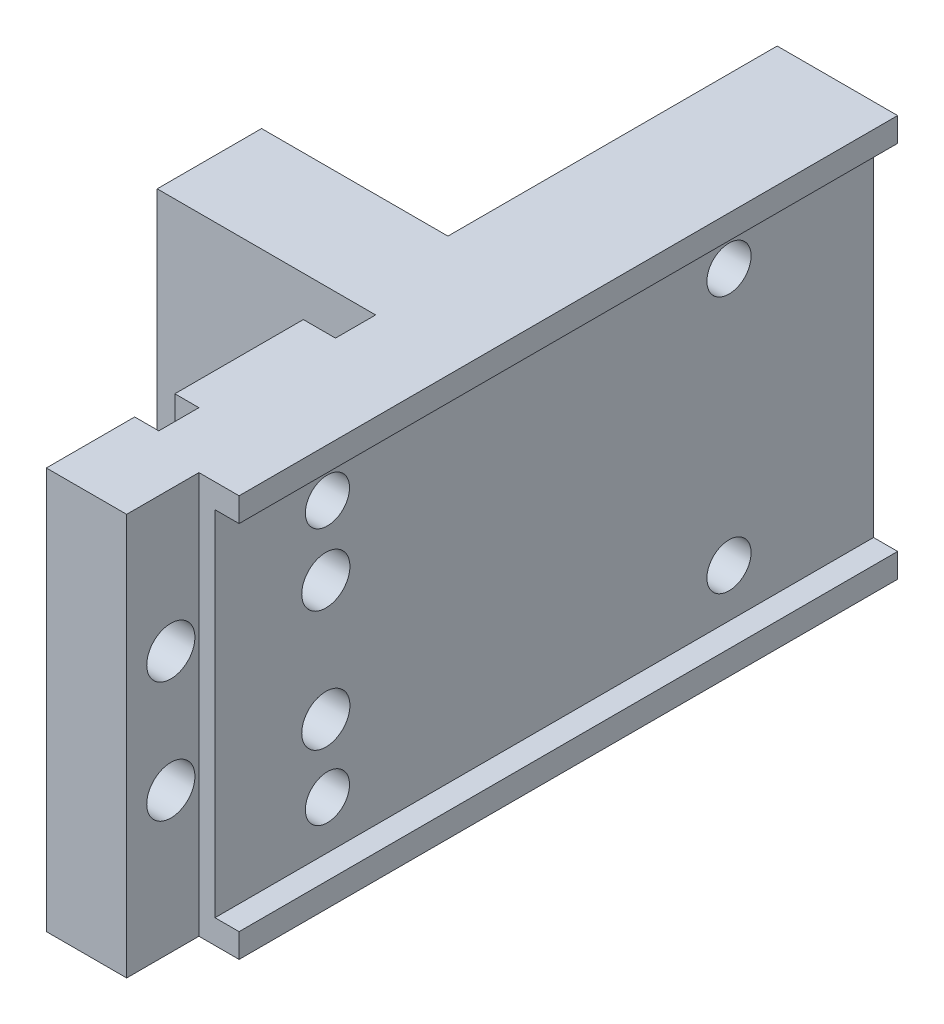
from build123d import *

# Parameters (mm, degrees)
LINEAR_AUSTRAGEN1_DEPTH                              = 25
SCHNITT_LINEAR_AUSTRAGEN1_REACH                      = 103.81
SKIZZE2_W                                            = 3
SKIZZE2_H                                            = 44
SCHNITT_LINEAR_AUSTRAGEN2_DEPTH                      = 5
F_16_5_16_5_DURCHMESSER_BOHRUNG1_D                   = 16.5
SCHNITT_LINEAR_AUSTRAGEN3_REACH                      = 69.707
SKIZZE7_W                                            = 1
SKIZZE7_H                                            = 25
STIRNSENKUNG_F_R_M6_ZYLINDERSCHRAUBE_MIT_D           = 6.6
STIRNSENKUNG_F_R_M6_ZYLINDERSCHRAUBE_MIT_DEPTH       = 13
STIRNSENKUNG_F_R_M6_ZYLINDERSCHRAUBE_MIT_CBORE_D     = 11
STIRNSENKUNG_F_R_M6_ZYLINDERSCHRAUBE_MIT_CBORE_DEPTH = 6
M6X1_0_GEWINDEBOHRUNG1_D                             = 5
M6X1_0_GEWINDEBOHRUNG1_DEPTH                         = 15
M6X1_0_GEWINDEBOHRUNG1_CBORE_D                       = 6
M6X1_0_GEWINDEBOHRUNG1_CBORE_DEPTH                   = 12
M6X1_0_GEWINDEBOHRUNG1_TIP                           = 1.502151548
F_5_5_5_5_DURCHMESSER_BOHRUNG1_D                     = 5.5
STIRNSENKUNG_F_R_M5_ZYLINDERSCHRAUBE_MIT_D           = 5.5
STIRNSENKUNG_F_R_M5_ZYLINDERSCHRAUBE_MIT_CBORE_D     = 10
STIRNSENKUNG_F_R_M5_ZYLINDERSCHRAUBE_MIT_CBORE_DEPTH = 5
M6X1_0_GEWINDEBOHRUNG3_D                             = 6
M6X1_0_GEWINDEBOHRUNG3_DEPTH                         = 12


with BuildPart() as part:
    # Skizze1 → Linear austragen1 (new, symmetric)
    with BuildSketch(Plane(origin=(0, 0, 0), x_dir=(1, 0, 0), z_dir=(0, 1, 0))):
        Polygon((-15, 41), (0, 41), (0, -41), (-5, -41), (-5, -50), (-15, -50), (-15, -39), (-12, -39), (-12, -34), (-15, -34), (-15, -18), (-11, -18), (-11, -13), (-38.2, -13), (-38.2, 0), (-15, 0), align=None)
    extrude(amount=LINEAR_AUSTRAGEN1_DEPTH, both=True)

    # Skizze2 → Schnitt-Linear austragen1 (cut, up to next)
    with BuildSketch(Plane(origin=(0, 0, -41), x_dir=(-1, 0, 0), z_dir=(0, 0, -1)), mode=Mode.PRIVATE) as schnitt_linear_austragen1_sk1:
        with Locations((1.5, 0)):
            Rectangle(SKIZZE2_W, SKIZZE2_H)
    schnitt_linear_austragen1_tool1 = extrude(schnitt_linear_austragen1_sk1.sketch, amount=-SCHNITT_LINEAR_AUSTRAGEN1_REACH, mode=Mode.PRIVATE) & part.part
    add(schnitt_linear_austragen1_tool1.solids().sort_by_distance((-1.5, 0, -41))[0], mode=Mode.SUBTRACT)

    # Skizze3 → Schnitt-Linear austragen2 (cut)
    with BuildSketch(Plane.ZY.offset(15)):
        with BuildLine():
            Line((-41, 22), (-6, 22))
            ThreePointArc((-6, 22), (-1.757359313, 20.242640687), (0, 16))
            Line((0, 16), (0, -16))
            ThreePointArc((0, -16), (-1.757359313, -20.242640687), (-6, -22))
            Line((-6, -22), (-41, -22))
            Line((-41, -22), (-41, 22))
        make_face()
    extrude(amount=-SCHNITT_LINEAR_AUSTRAGEN2_DEPTH, mode=Mode.SUBTRACT)

    # 16.5 _16.5_ Durchmesser Bohrung1 (through all)
    with Locations(Plane(origin=(0, 0, 0), x_dir=(-1, 0, 0), z_dir=(0, 0, -1))):
        with Locations((24.7, 0)):
            Hole(F_16_5_16_5_DURCHMESSER_BOHRUNG1_D / 2)

    # Skizze7 → Schnitt-Linear austragen3 (cut, up to next)
    with BuildSketch(Plane(origin=(0, 0, 0), x_dir=(-1, 0, 0), z_dir=(0, 0, -1)), mode=Mode.PRIVATE) as schnitt_linear_austragen3_sk1:
        with Locations((24.7, -12.5)):
            Rectangle(SKIZZE7_W, SKIZZE7_H)
    schnitt_linear_austragen3_tool1 = extrude(schnitt_linear_austragen3_sk1.sketch, amount=-SCHNITT_LINEAR_AUSTRAGEN3_REACH, mode=Mode.PRIVATE) & part.part
    add(schnitt_linear_austragen3_tool1.solids().sort_by_distance((-24.7, -12.5, 0))[0], mode=Mode.SUBTRACT)

    # Stirnsenkung f_r M6 Zylinderschraube mit
    with Locations(Plane.ZY.offset(38.2)):
        with Locations((6.5, -15)):
            CounterBoreHole(STIRNSENKUNG_F_R_M6_ZYLINDERSCHRAUBE_MIT_D / 2, STIRNSENKUNG_F_R_M6_ZYLINDERSCHRAUBE_MIT_CBORE_D / 2, STIRNSENKUNG_F_R_M6_ZYLINDERSCHRAUBE_MIT_CBORE_DEPTH, depth=STIRNSENKUNG_F_R_M6_ZYLINDERSCHRAUBE_MIT_DEPTH)

    # M6x1.0 Gewindebohrung1
    with Locations(Plane.ZY.offset(24.2)):
        with Locations((6.5, -15)):
            CounterBoreHole(M6X1_0_GEWINDEBOHRUNG1_D / 2, M6X1_0_GEWINDEBOHRUNG1_CBORE_D / 2, M6X1_0_GEWINDEBOHRUNG1_CBORE_DEPTH, depth=M6X1_0_GEWINDEBOHRUNG1_DEPTH)
            with Locations((0, 0, -(M6X1_0_GEWINDEBOHRUNG1_DEPTH + M6X1_0_GEWINDEBOHRUNG1_TIP / 2))):  # 118° drill point
                Cone(0, M6X1_0_GEWINDEBOHRUNG1_D / 2, M6X1_0_GEWINDEBOHRUNG1_TIP, mode=Mode.SUBTRACT)

    # 5.5 _5.5_ Durchmesser Bohrung1 (through all)
    with Locations(Plane.ZY.offset(10)):
        with Locations((-23, 16), (-23, -16)):
            Hole(F_5_5_5_5_DURCHMESSER_BOHRUNG1_D / 2)

    # Stirnsenkung f_r M5 Zylinderschraube mit (through all)
    with Locations(Plane.ZY.offset(15)):
        with Locations((27, 16), (27, -16)):
            CounterBoreHole(STIRNSENKUNG_F_R_M5_ZYLINDERSCHRAUBE_MIT_D / 2, STIRNSENKUNG_F_R_M5_ZYLINDERSCHRAUBE_MIT_CBORE_D / 2, STIRNSENKUNG_F_R_M5_ZYLINDERSCHRAUBE_MIT_CBORE_DEPTH)

    # M6x1.0 Gewindebohrung3
    with Locations(Plane.ZY.offset(15)):
        with Locations((27.2, 7.5), (44.5, 7.5), (44.5, -7.5), (27.2, -7.5)):
            Hole(M6X1_0_GEWINDEBOHRUNG3_D / 2, depth=M6X1_0_GEWINDEBOHRUNG3_DEPTH)


solid = part.part
